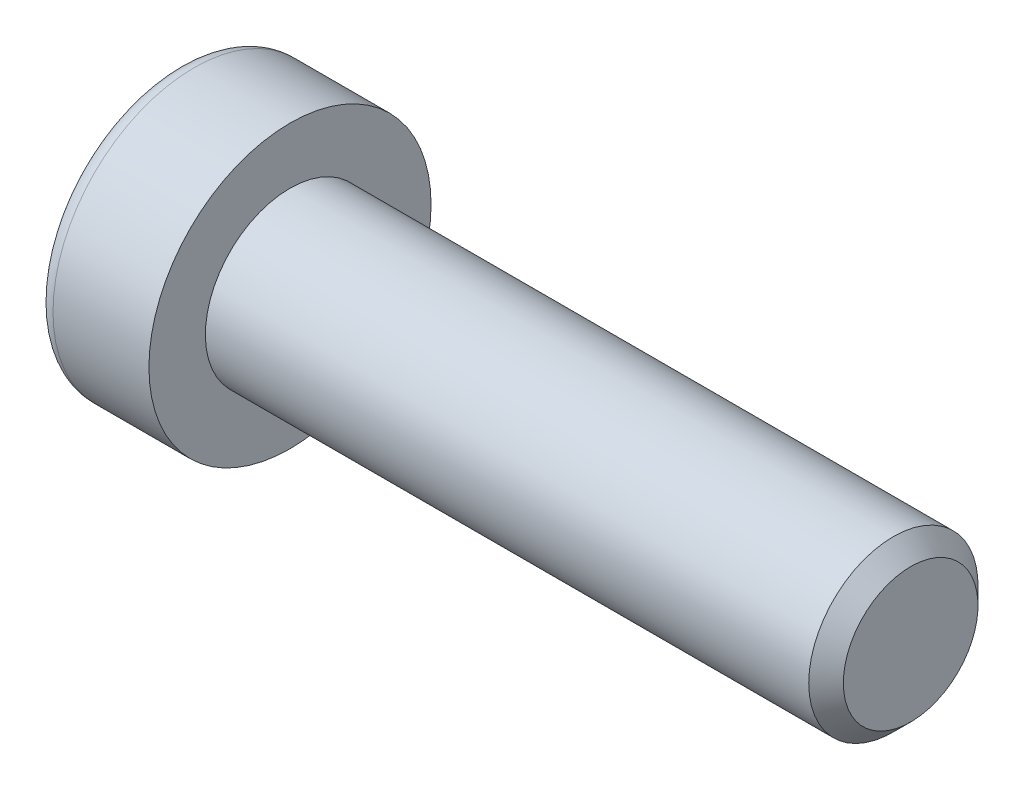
ISO-10303-21;
HEADER;
FILE_DESCRIPTION(('STEP AP214'),'2;1');
FILE_NAME('part.step','',(''),(''),'','','');
FILE_SCHEMA(('AUTOMOTIVE_DESIGN { 1 0 10303 214 1 1 1 1 }'));
ENDSEC;
DATA;
#1=APPLICATION_CONTEXT('core data for automotive mechanical design processes');
#2=APPLICATION_PROTOCOL_DEFINITION('international standard','automotive_design',2000,#1);
#3=PRODUCT_CONTEXT('',#1,'mechanical');
#4=PRODUCT('Part','Part','',(#3));
#5=PRODUCT_RELATED_PRODUCT_CATEGORY('part','',(#4));
#6=PRODUCT_DEFINITION_FORMATION('','',#4);
#7=PRODUCT_DEFINITION_CONTEXT('part definition',#1,'design');
#8=PRODUCT_DEFINITION('design','',#6,#7);
#9=PRODUCT_DEFINITION_SHAPE('','',#8);
#10=(LENGTH_UNIT() NAMED_UNIT(*) SI_UNIT(.MILLI.,.METRE.));
#11=(NAMED_UNIT(*) PLANE_ANGLE_UNIT() SI_UNIT($,.RADIAN.));
#12=(NAMED_UNIT(*) SI_UNIT($,.STERADIAN.) SOLID_ANGLE_UNIT());
#13=UNCERTAINTY_MEASURE_WITH_UNIT(LENGTH_MEASURE(1.E-05),#10,'distance_accuracy_value','');
#14=(GEOMETRIC_REPRESENTATION_CONTEXT(3) GLOBAL_UNCERTAINTY_ASSIGNED_CONTEXT((#13)) GLOBAL_UNIT_ASSIGNED_CONTEXT((#10,
#11,#12)) REPRESENTATION_CONTEXT('',''));
#15=CARTESIAN_POINT('',(0.,0.,0.));
#16=DIRECTION('',(0.,0.,1.));
#17=DIRECTION('',(1.,0.,0.));
#18=AXIS2_PLACEMENT_3D('',#15,#16,#17);
#19=CARTESIAN_POINT('',(-1.00800000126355,0.,0.));
#20=DIRECTION('',(-1.,0.,0.));
#21=DIRECTION('',(0.,0.,1.));
#22=AXIS2_PLACEMENT_3D('',#19,#20,#21);
#23=CONICAL_SURFACE('',#22,2.32325748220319,1.04719754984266);
#24=CARTESIAN_POINT('',(0.333333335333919,-2.27373675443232E-10,0.));
#25=VERTEX_POINT('',#24);
#26=VERTEX_LOOP('',#25);
#27=FACE_BOUND('',#26,.T.);
#28=CARTESIAN_POINT('',(-1.00000000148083,2.00000000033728,1.15470053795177));
#29=CARTESIAN_POINT('',(-0.970695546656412,2.00000000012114,1.05321634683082));
#30=CARTESIAN_POINT('',(-0.944044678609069,2.00000000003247,0.950856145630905));
#31=CARTESIAN_POINT('',(-0.897526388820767,1.99999999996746,0.744363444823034));
#32=CARTESIAN_POINT('',(-0.877675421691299,1.99999999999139,0.640227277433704));
#33=CARTESIAN_POINT('',(-0.84677596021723,2.0000000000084,0.433245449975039));
#34=CARTESIAN_POINT('',(-0.835521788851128,2.00000000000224,0.330431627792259));
#35=CARTESIAN_POINT('',(-0.822089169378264,1.99999999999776,0.124320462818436));
#36=CARTESIAN_POINT('',(-0.819899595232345,1.99999999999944,0.021023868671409));
#37=CARTESIAN_POINT('',(-0.824466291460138,2.00000000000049,-0.17197473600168));
#38=CARTESIAN_POINT('',(-0.830101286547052,2.00000000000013,-0.261705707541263));
#39=CARTESIAN_POINT('',(-0.847957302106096,1.99999999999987,-0.440583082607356));
#40=CARTESIAN_POINT('',(-0.86018441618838,1.99999999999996,-0.529728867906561));
#41=CARTESIAN_POINT('',(-0.890749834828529,2.00000000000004,-0.708974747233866));
#42=CARTESIAN_POINT('',(-0.909217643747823,2.00000000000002,-0.799052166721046));
#43=CARTESIAN_POINT('',(-0.95113176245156,1.99999999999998,-0.977863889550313));
#44=CARTESIAN_POINT('',(-0.974568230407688,1.99999999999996,-1.06660048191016));
#45=CARTESIAN_POINT('',(-1.00000000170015,2.,-1.15470053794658));
#46=B_SPLINE_CURVE_WITH_KNOTS('',3,(#28,#29,#30,#31,#32,#33,#34,#35,#36,#37,#38,#39,#40,#41,#42,
#43,#44,#45),.UNSPECIFIED.,.F.,.F.,(4,2,2,2,2,2,2,2,4),(0.,0.317016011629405,0.634793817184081,
0.944707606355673,1.25424088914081,1.52370778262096,1.79342419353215,2.06912162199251,
2.34427797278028),.UNSPECIFIED.);
#47=CARTESIAN_POINT('',(-1.00000000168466,1.99999999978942,1.15470053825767));
#48=VERTEX_POINT('',#47);
#49=CARTESIAN_POINT('',(-1.00000000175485,2.,-1.15470053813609));
#50=VERTEX_POINT('',#49);
#51=EDGE_CURVE('E20',#48,#50,#46,.T.);
#52=ORIENTED_EDGE('',*,*,#51,.T.);
#53=CARTESIAN_POINT('',(-1.00000000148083,1.99999999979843,-1.15470053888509));
#54=CARTESIAN_POINT('',(-0.970695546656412,1.91211211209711,-1.20544263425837));
#55=CARTESIAN_POINT('',(-0.944044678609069,1.82346557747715,-1.25662273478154));
#56=CARTESIAN_POINT('',(-0.897526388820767,1.64463765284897,-1.35986908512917));
#57=CARTESIAN_POINT('',(-0.877675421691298,1.55445308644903,-1.41193716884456));
#58=CARTESIAN_POINT('',(-0.846775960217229,1.37520156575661,-1.51542808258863));
#59=CARTESIAN_POINT('',(-0.835521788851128,1.28616218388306,-1.56683499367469));
#60=CARTESIAN_POINT('',(-0.822089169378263,1.10766467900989,-1.66989057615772));
#61=CARTESIAN_POINT('',(-0.819899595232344,1.01820720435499,-1.72153887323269));
#62=CARTESIAN_POINT('',(-0.824466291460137,0.851065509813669,-1.81803817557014));
#63=CARTESIAN_POINT('',(-0.830101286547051,0.773356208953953,-1.86290366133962));
#64=CARTESIAN_POINT('',(-0.847957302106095,0.618443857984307,-1.95234234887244));
#65=CARTESIAN_POINT('',(-0.860184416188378,0.541241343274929,-1.99691524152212));
#66=CARTESIAN_POINT('',(-0.890749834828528,0.38600985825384,-2.08653818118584));
#67=CARTESIAN_POINT('',(-0.909217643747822,0.308000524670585,-2.13157689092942));
#68=CARTESIAN_POINT('',(-0.951131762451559,0.153145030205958,-2.22098275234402));
#69=CARTESIAN_POINT('',(-0.974568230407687,0.0762968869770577,-2.26535104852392));
#70=CARTESIAN_POINT('',(-1.00000000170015,3.74707656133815E-10,-2.30940107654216));
#71=B_SPLINE_CURVE_WITH_KNOTS('',3,(#53,#54,#55,#56,#57,#58,#59,#60,#61,#62,#63,#64,#65,#66,#67,
#68,#69,#70),.UNSPECIFIED.,.F.,.F.,(4,2,2,2,2,2,2,2,4),(0.,0.317016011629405,0.63479381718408,
0.944707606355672,1.25424088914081,1.52370778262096,1.79342419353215,2.06912162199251,
2.34427797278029),.UNSPECIFIED.);
#72=CARTESIAN_POINT('',(-1.00000000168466,0.,-2.30940107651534));
#73=VERTEX_POINT('',#72);
#74=EDGE_CURVE('E80',#50,#73,#71,.T.);
#75=ORIENTED_EDGE('',*,*,#74,.T.);
#76=CARTESIAN_POINT('',(-1.00000000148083,-5.38851016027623E-10,-2.30940107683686));
#77=CARTESIAN_POINT('',(-0.970695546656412,-0.0878878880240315,-2.2586589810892));
#78=CARTESIAN_POINT('',(-0.944044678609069,-0.176534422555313,-2.20747888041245));
#79=CARTESIAN_POINT('',(-0.897526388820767,-0.355362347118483,-2.10423252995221));
#80=CARTESIAN_POINT('',(-0.877675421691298,-0.445546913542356,-2.05216444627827));
#81=CARTESIAN_POINT('',(-0.846775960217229,-0.624798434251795,-1.94867353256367));
#82=CARTESIAN_POINT('',(-0.835521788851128,-0.713837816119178,-1.89726662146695));
#83=CARTESIAN_POINT('',(-0.822089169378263,-0.892335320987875,-1.79421103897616));
#84=CARTESIAN_POINT('',(-0.819899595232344,-0.98179279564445,-1.7425627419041));
#85=CARTESIAN_POINT('',(-0.824466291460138,-1.14893449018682,-1.64606343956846));
#86=CARTESIAN_POINT('',(-0.830101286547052,-1.22664379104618,-1.60119795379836));
#87=CARTESIAN_POINT('',(-0.847957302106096,-1.38155614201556,-1.51175926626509));
#88=CARTESIAN_POINT('',(-0.860184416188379,-1.45875865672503,-1.46718637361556));
#89=CARTESIAN_POINT('',(-0.890749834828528,-1.6139901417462,-1.37756343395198));
#90=CARTESIAN_POINT('',(-0.909217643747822,-1.69199947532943,-1.33252472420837));
#91=CARTESIAN_POINT('',(-0.951131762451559,-1.84685496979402,-1.2431188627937));
#92=CARTESIAN_POINT('',(-0.974568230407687,-1.9237031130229,-1.19875056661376));
#93=CARTESIAN_POINT('',(-1.00000000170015,-1.99999999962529,-1.15470053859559));
#94=B_SPLINE_CURVE_WITH_KNOTS('',3,(#76,#77,#78,#79,#80,#81,#82,#83,#84,#85,#86,#87,#88,#89,#90,
#91,#92,#93),.UNSPECIFIED.,.F.,.F.,(4,2,2,2,2,2,2,2,4),(0.,0.317016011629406,0.634793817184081,
0.944707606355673,1.25424088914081,1.52370778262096,1.79342419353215,2.06912162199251,
2.34427797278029),.UNSPECIFIED.);
#95=CARTESIAN_POINT('',(-1.00000000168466,-1.99999999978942,-1.15470053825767));
#96=VERTEX_POINT('',#95);
#97=EDGE_CURVE('E105',#73,#96,#94,.T.);
#98=ORIENTED_EDGE('',*,*,#97,.T.);
#99=CARTESIAN_POINT('',(-1.00000000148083,-2.00000000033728,-1.15470053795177));
#100=CARTESIAN_POINT('',(-0.970695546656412,-2.00000000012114,-1.05321634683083));
#101=CARTESIAN_POINT('',(-0.944044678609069,-2.00000000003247,-0.950856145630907));
#102=CARTESIAN_POINT('',(-0.897526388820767,-1.99999999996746,-0.744363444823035));
#103=CARTESIAN_POINT('',(-0.877675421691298,-1.99999999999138,-0.640227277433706));
#104=CARTESIAN_POINT('',(-0.846775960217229,-2.0000000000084,-0.433245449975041));
#105=CARTESIAN_POINT('',(-0.835521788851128,-2.00000000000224,-0.330431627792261));
#106=CARTESIAN_POINT('',(-0.822089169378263,-1.99999999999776,-0.124320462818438));
#107=CARTESIAN_POINT('',(-0.819899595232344,-1.99999999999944,-0.0210238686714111));
#108=CARTESIAN_POINT('',(-0.824466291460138,-2.00000000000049,0.171974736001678));
#109=CARTESIAN_POINT('',(-0.830101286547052,-2.00000000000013,0.261705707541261));
#110=CARTESIAN_POINT('',(-0.847957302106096,-1.99999999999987,0.440583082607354));
#111=CARTESIAN_POINT('',(-0.860184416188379,-1.99999999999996,0.52972886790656));
#112=CARTESIAN_POINT('',(-0.890749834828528,-2.00000000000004,0.708974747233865));
#113=CARTESIAN_POINT('',(-0.909217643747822,-2.00000000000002,0.799052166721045));
#114=CARTESIAN_POINT('',(-0.951131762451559,-1.99999999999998,0.977863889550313));
#115=CARTESIAN_POINT('',(-0.974568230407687,-1.99999999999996,1.06660048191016));
#116=CARTESIAN_POINT('',(-1.00000000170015,-2.,1.15470053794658));
#117=B_SPLINE_CURVE_WITH_KNOTS('',3,(#99,#100,#101,#102,#103,#104,#105,#106,#107,#108,#109,#110,
#111,#112,#113,#114,#115,#116),.UNSPECIFIED.,.F.,.F.,(4,2,2,2,2,2,2,2,4),(0.,0.317016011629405,
0.63479381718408,0.944707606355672,1.25424088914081,1.52370778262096,1.79342419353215,
2.06912162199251,2.34427797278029),.UNSPECIFIED.);
#118=CARTESIAN_POINT('',(-1.00000000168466,-1.99999999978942,1.15470053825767));
#119=VERTEX_POINT('',#118);
#120=EDGE_CURVE('E129',#96,#119,#117,.T.);
#121=ORIENTED_EDGE('',*,*,#120,.T.);
#122=CARTESIAN_POINT('',(-1.00000000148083,-1.99999999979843,1.15470053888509));
#123=CARTESIAN_POINT('',(-0.970695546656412,-1.91211211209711,1.20544263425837));
#124=CARTESIAN_POINT('',(-0.944044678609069,-1.82346557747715,1.25662273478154));
#125=CARTESIAN_POINT('',(-0.897526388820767,-1.64463765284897,1.35986908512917));
#126=CARTESIAN_POINT('',(-0.877675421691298,-1.55445308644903,1.41193716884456));
#127=CARTESIAN_POINT('',(-0.846775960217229,-1.37520156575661,1.51542808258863));
#128=CARTESIAN_POINT('',(-0.835521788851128,-1.28616218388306,1.56683499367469));
#129=CARTESIAN_POINT('',(-0.822089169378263,-1.10766467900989,1.66989057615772));
#130=CARTESIAN_POINT('',(-0.819899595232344,-1.01820720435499,1.72153887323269));
#131=CARTESIAN_POINT('',(-0.824466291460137,-0.85106550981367,1.81803817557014));
#132=CARTESIAN_POINT('',(-0.830101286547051,-0.773356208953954,1.86290366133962));
#133=CARTESIAN_POINT('',(-0.847957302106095,-0.618443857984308,1.95234234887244));
#134=CARTESIAN_POINT('',(-0.860184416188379,-0.54124134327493,1.99691524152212));
#135=CARTESIAN_POINT('',(-0.890749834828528,-0.386009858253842,2.08653818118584));
#136=CARTESIAN_POINT('',(-0.909217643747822,-0.308000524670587,2.13157689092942));
#137=CARTESIAN_POINT('',(-0.951131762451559,-0.15314503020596,2.22098275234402));
#138=CARTESIAN_POINT('',(-0.974568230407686,-0.0762968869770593,2.26535104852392));
#139=CARTESIAN_POINT('',(-1.00000000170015,-3.74709270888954E-10,2.30940107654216));
#140=B_SPLINE_CURVE_WITH_KNOTS('',3,(#122,#123,#124,#125,#126,#127,#128,#129,#130,#131,#132,
#133,#134,#135,#136,#137,#138,#139),.UNSPECIFIED.,.F.,.F.,(4,2,2,2,2,2,2,2,4),(0.,
0.317016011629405,0.63479381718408,0.944707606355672,1.25424088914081,1.52370778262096,
1.79342419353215,2.06912162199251,2.34427797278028),.UNSPECIFIED.);
#141=CARTESIAN_POINT('',(-1.00000000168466,0.,2.30940107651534));
#142=VERTEX_POINT('',#141);
#143=EDGE_CURVE('E137',#119,#142,#140,.T.);
#144=ORIENTED_EDGE('',*,*,#143,.T.);
#145=CARTESIAN_POINT('',(-1.00000000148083,5.38850869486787E-10,2.30940107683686));
#146=CARTESIAN_POINT('',(-0.970695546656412,0.0878878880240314,2.2586589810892));
#147=CARTESIAN_POINT('',(-0.944044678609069,0.176534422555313,2.20747888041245));
#148=CARTESIAN_POINT('',(-0.897526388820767,0.355362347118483,2.10423252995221));
#149=CARTESIAN_POINT('',(-0.877675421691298,0.445546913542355,2.05216444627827));
#150=CARTESIAN_POINT('',(-0.846775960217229,0.624798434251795,1.94867353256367));
#151=CARTESIAN_POINT('',(-0.835521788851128,0.713837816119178,1.89726662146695));
#152=CARTESIAN_POINT('',(-0.822089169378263,0.892335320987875,1.79421103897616));
#153=CARTESIAN_POINT('',(-0.819899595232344,0.981792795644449,1.7425627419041));
#154=CARTESIAN_POINT('',(-0.824466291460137,1.14893449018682,1.64606343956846));
#155=CARTESIAN_POINT('',(-0.830101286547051,1.22664379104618,1.60119795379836));
#156=CARTESIAN_POINT('',(-0.847957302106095,1.38155614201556,1.51175926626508));
#157=CARTESIAN_POINT('',(-0.860184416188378,1.45875865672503,1.46718637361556));
#158=CARTESIAN_POINT('',(-0.890749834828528,1.6139901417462,1.37756343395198));
#159=CARTESIAN_POINT('',(-0.909217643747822,1.69199947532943,1.33252472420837));
#160=CARTESIAN_POINT('',(-0.951131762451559,1.84685496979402,1.2431188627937));
#161=CARTESIAN_POINT('',(-0.974568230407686,1.9237031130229,1.19875056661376));
#162=CARTESIAN_POINT('',(-1.00000000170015,1.99999999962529,1.15470053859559));
#163=B_SPLINE_CURVE_WITH_KNOTS('',3,(#145,#146,#147,#148,#149,#150,#151,#152,#153,#154,#155,
#156,#157,#158,#159,#160,#161,#162),.UNSPECIFIED.,.F.,.F.,(4,2,2,2,2,2,2,2,4),(0.,
0.317016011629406,0.63479381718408,0.944707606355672,1.25424088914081,1.52370778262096,
1.79342419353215,2.06912162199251,2.34427797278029),.UNSPECIFIED.);
#164=EDGE_CURVE('E82',#142,#48,#163,.T.);
#165=ORIENTED_EDGE('',*,*,#164,.T.);
#166=EDGE_LOOP('',(#52,#75,#98,#121,#144,#165));
#167=FACE_BOUND('',#166,.T.);
#168=ADVANCED_FACE('F16',(#27,#167),#23,.F.);
#169=CARTESIAN_POINT('',(-3.99999999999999,2.,1.15470053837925));
#170=DIRECTION('',(0.,1.,0.));
#171=DIRECTION('',(0.,0.,1.));
#172=AXIS2_PLACEMENT_3D('',#169,#170,#171);
#173=PLANE('',#172);
#174=DIRECTION('',(1.,0.,0.));
#175=VECTOR('',#174,1.);
#176=CARTESIAN_POINT('',(-3.99999999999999,2.,1.15470053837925));
#177=LINE('',#176,#175);
#178=CARTESIAN_POINT('',(-3.99999999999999,2.,1.15470053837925));
#179=VERTEX_POINT('',#178);
#180=EDGE_CURVE('E84',#48,#179,#177,.F.);
#181=ORIENTED_EDGE('',*,*,#180,.T.);
#182=DIRECTION('',(0.,0.,1.));
#183=VECTOR('',#182,1.);
#184=CARTESIAN_POINT('',(-3.99999999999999,2.,0.));
#185=LINE('',#184,#183);
#186=CARTESIAN_POINT('',(-3.99999999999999,2.,-1.15470053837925));
#187=VERTEX_POINT('',#186);
#188=EDGE_CURVE('E89',#187,#179,#185,.T.);
#189=ORIENTED_EDGE('',*,*,#188,.F.);
#190=DIRECTION('',(1.,0.,0.));
#191=VECTOR('',#190,1.);
#192=CARTESIAN_POINT('',(-3.99999999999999,2.,-1.15470053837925));
#193=LINE('',#192,#191);
#194=EDGE_CURVE('E87',#187,#50,#193,.T.);
#195=ORIENTED_EDGE('',*,*,#194,.T.);
#196=ORIENTED_EDGE('',*,*,#51,.F.);
#197=EDGE_LOOP('',(#181,#189,#195,#196));
#198=FACE_BOUND('',#197,.T.);
#199=ADVANCED_FACE('F76',(#198),#173,.F.);
#200=CARTESIAN_POINT('',(-3.99999999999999,0.,2.3094010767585));
#201=DIRECTION('',(0.,0.500000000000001,0.866025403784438));
#202=DIRECTION('',(0.,-0.866025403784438,0.500000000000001));
#203=AXIS2_PLACEMENT_3D('',#200,#201,#202);
#204=PLANE('',#203);
#205=DIRECTION('',(1.,0.,0.));
#206=VECTOR('',#205,1.);
#207=CARTESIAN_POINT('',(-3.99999999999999,0.,2.3094010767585));
#208=LINE('',#207,#206);
#209=CARTESIAN_POINT('',(-3.99999999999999,0.,2.3094010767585));
#210=VERTEX_POINT('',#209);
#211=EDGE_CURVE('E141',#142,#210,#208,.F.);
#212=ORIENTED_EDGE('',*,*,#211,.T.);
#213=DIRECTION('',(0.,-0.866025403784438,0.500000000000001));
#214=VECTOR('',#213,1.);
#215=CARTESIAN_POINT('',(-3.99999999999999,2.,1.15470053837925));
#216=LINE('',#215,#214);
#217=EDGE_CURVE('E95',#179,#210,#216,.T.);
#218=ORIENTED_EDGE('',*,*,#217,.F.);
#219=ORIENTED_EDGE('',*,*,#180,.F.);
#220=ORIENTED_EDGE('',*,*,#164,.F.);
#221=EDGE_LOOP('',(#212,#218,#219,#220));
#222=FACE_BOUND('',#221,.T.);
#223=ADVANCED_FACE('F145',(#222),#204,.F.);
#224=CARTESIAN_POINT('',(-3.99999999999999,-2.,1.15470053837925));
#225=DIRECTION('',(0.,-0.5,0.866025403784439));
#226=DIRECTION('',(0.,-0.866025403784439,-0.5));
#227=AXIS2_PLACEMENT_3D('',#224,#225,#226);
#228=PLANE('',#227);
#229=DIRECTION('',(1.,0.,0.));
#230=VECTOR('',#229,1.);
#231=CARTESIAN_POINT('',(-3.99999999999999,-2.,1.15470053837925));
#232=LINE('',#231,#230);
#233=CARTESIAN_POINT('',(-3.99999999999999,-2.,1.15470053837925));
#234=VERTEX_POINT('',#233);
#235=EDGE_CURVE('E136',#119,#234,#232,.F.);
#236=ORIENTED_EDGE('',*,*,#235,.T.);
#237=DIRECTION('',(0.,-0.866025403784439,-0.5));
#238=VECTOR('',#237,1.);
#239=CARTESIAN_POINT('',(-3.99999999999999,0.,2.3094010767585));
#240=LINE('',#239,#238);
#241=EDGE_CURVE('E224',#210,#234,#240,.T.);
#242=ORIENTED_EDGE('',*,*,#241,.F.);
#243=ORIENTED_EDGE('',*,*,#211,.F.);
#244=ORIENTED_EDGE('',*,*,#143,.F.);
#245=EDGE_LOOP('',(#236,#242,#243,#244));
#246=FACE_BOUND('',#245,.T.);
#247=ADVANCED_FACE('F125',(#246),#228,.F.);
#248=CARTESIAN_POINT('',(-3.99999999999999,-2.,-1.15470053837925));
#249=DIRECTION('',(0.,-1.,0.));
#250=DIRECTION('',(0.,0.,-1.));
#251=AXIS2_PLACEMENT_3D('',#248,#249,#250);
#252=PLANE('',#251);
#253=DIRECTION('',(1.,0.,0.));
#254=VECTOR('',#253,1.);
#255=CARTESIAN_POINT('',(-3.99999999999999,-2.,-1.15470053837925));
#256=LINE('',#255,#254);
#257=CARTESIAN_POINT('',(-3.99999999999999,-2.,-1.15470053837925));
#258=VERTEX_POINT('',#257);
#259=EDGE_CURVE('E135',#96,#258,#256,.F.);
#260=ORIENTED_EDGE('',*,*,#259,.T.);
#261=DIRECTION('',(0.,0.,1.));
#262=VECTOR('',#261,1.);
#263=CARTESIAN_POINT('',(-3.99999999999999,-2.,0.));
#264=LINE('',#263,#262);
#265=EDGE_CURVE('E221',#234,#258,#264,.F.);
#266=ORIENTED_EDGE('',*,*,#265,.F.);
#267=ORIENTED_EDGE('',*,*,#235,.F.);
#268=ORIENTED_EDGE('',*,*,#120,.F.);
#269=EDGE_LOOP('',(#260,#266,#267,#268));
#270=FACE_BOUND('',#269,.T.);
#271=ADVANCED_FACE('F121',(#270),#252,.F.);
#272=CARTESIAN_POINT('',(-3.99999999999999,0.,-2.3094010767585));
#273=DIRECTION('',(0.,-0.5,-0.866025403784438));
#274=DIRECTION('',(0.,0.866025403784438,-0.5));
#275=AXIS2_PLACEMENT_3D('',#272,#273,#274);
#276=PLANE('',#275);
#277=DIRECTION('',(1.,0.,0.));
#278=VECTOR('',#277,1.);
#279=CARTESIAN_POINT('',(-3.99999999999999,0.,-2.3094010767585));
#280=LINE('',#279,#278);
#281=CARTESIAN_POINT('',(-3.99999999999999,0.,-2.3094010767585));
#282=VERTEX_POINT('',#281);
#283=EDGE_CURVE('E38',#73,#282,#280,.F.);
#284=ORIENTED_EDGE('',*,*,#283,.T.);
#285=DIRECTION('',(0.,0.866025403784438,-0.5));
#286=VECTOR('',#285,1.);
#287=CARTESIAN_POINT('',(-3.99999999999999,-2.,-1.15470053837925));
#288=LINE('',#287,#286);
#289=EDGE_CURVE('E218',#258,#282,#288,.T.);
#290=ORIENTED_EDGE('',*,*,#289,.F.);
#291=ORIENTED_EDGE('',*,*,#259,.F.);
#292=ORIENTED_EDGE('',*,*,#97,.F.);
#293=EDGE_LOOP('',(#284,#290,#291,#292));
#294=FACE_BOUND('',#293,.T.);
#295=ADVANCED_FACE('F115',(#294),#276,.F.);
#296=CARTESIAN_POINT('',(-3.99999999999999,2.,-1.15470053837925));
#297=DIRECTION('',(0.,0.5,-0.866025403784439));
#298=DIRECTION('',(0.,0.866025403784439,0.5));
#299=AXIS2_PLACEMENT_3D('',#296,#297,#298);
#300=PLANE('',#299);
#301=ORIENTED_EDGE('',*,*,#194,.F.);
#302=DIRECTION('',(0.,0.866025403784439,0.5));
#303=VECTOR('',#302,1.);
#304=CARTESIAN_POINT('',(-3.99999999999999,0.,-2.3094010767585));
#305=LINE('',#304,#303);
#306=EDGE_CURVE('E216',#282,#187,#305,.T.);
#307=ORIENTED_EDGE('',*,*,#306,.F.);
#308=ORIENTED_EDGE('',*,*,#283,.F.);
#309=ORIENTED_EDGE('',*,*,#74,.F.);
#310=EDGE_LOOP('',(#301,#307,#308,#309));
#311=FACE_BOUND('',#310,.T.);
#312=ADVANCED_FACE('F93',(#311),#300,.F.);
#313=CARTESIAN_POINT('',(-3.99999999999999,3.65470053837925,0.));
#314=DIRECTION('',(-1.,0.,0.));
#315=DIRECTION('',(0.,0.,1.));
#316=AXIS2_PLACEMENT_3D('',#313,#314,#315);
#317=PLANE('',#316);
#318=ORIENTED_EDGE('',*,*,#289,.T.);
#319=ORIENTED_EDGE('',*,*,#306,.T.);
#320=ORIENTED_EDGE('',*,*,#188,.T.);
#321=ORIENTED_EDGE('',*,*,#217,.T.);
#322=ORIENTED_EDGE('',*,*,#241,.T.);
#323=ORIENTED_EDGE('',*,*,#265,.T.);
#324=EDGE_LOOP('',(#318,#319,#320,#321,#322,#323));
#325=FACE_BOUND('',#324,.T.);
#326=CARTESIAN_POINT('',(-3.99999999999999,0.,0.));
#327=DIRECTION('',(1.,0.,0.));
#328=DIRECTION('',(0.,1.,0.));
#329=AXIS2_PLACEMENT_3D('',#326,#327,#328);
#330=CIRCLE('',#329,4.4);
#331=CARTESIAN_POINT('',(-3.99999999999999,4.4,0.));
#332=VERTEX_POINT('',#331);
#333=EDGE_CURVE('E193',#332,#332,#330,.T.);
#334=ORIENTED_EDGE('',*,*,#333,.F.);
#335=EDGE_LOOP('',(#334));
#336=FACE_BOUND('',#335,.T.);
#337=ADVANCED_FACE('F114',(#325,#336),#317,.T.);
#338=CARTESIAN_POINT('',(-3.4,0.,0.));
#339=DIRECTION('',(1.,0.,0.));
#340=DIRECTION('',(0.,0.,-1.));
#341=AXIS2_PLACEMENT_3D('',#338,#339,#340);
#342=TOROIDAL_SURFACE('',#341,4.4,0.6);
#343=CARTESIAN_POINT('',(-3.4,0.,0.));
#344=DIRECTION('',(1.,0.,0.));
#345=DIRECTION('',(0.,1.,0.));
#346=AXIS2_PLACEMENT_3D('',#343,#344,#345);
#347=CIRCLE('',#346,5.);
#348=CARTESIAN_POINT('',(-3.4,5.,0.));
#349=VERTEX_POINT('',#348);
#350=EDGE_CURVE('E234',#349,#349,#347,.T.);
#351=ORIENTED_EDGE('',*,*,#350,.F.);
#352=EDGE_LOOP('',(#351));
#353=FACE_BOUND('',#352,.T.);
#354=ORIENTED_EDGE('',*,*,#333,.T.);
#355=EDGE_LOOP('',(#354));
#356=FACE_BOUND('',#355,.T.);
#357=ADVANCED_FACE('F177',(#353,#356),#342,.T.);
#358=CARTESIAN_POINT('',(-2.,0.,0.));
#359=DIRECTION('',(1.,0.,0.));
#360=DIRECTION('',(0.,1.,0.));
#361=AXIS2_PLACEMENT_3D('',#358,#359,#360);
#362=CYLINDRICAL_SURFACE('',#361,5.);
#363=ORIENTED_EDGE('',*,*,#350,.T.);
#364=EDGE_LOOP('',(#363));
#365=FACE_BOUND('',#364,.T.);
#366=CARTESIAN_POINT('',(0.,0.,0.));
#367=DIRECTION('',(1.,0.,0.));
#368=DIRECTION('',(0.,1.,0.));
#369=AXIS2_PLACEMENT_3D('',#366,#367,#368);
#370=CIRCLE('',#369,5.);
#371=CARTESIAN_POINT('',(0.,5.,0.));
#372=VERTEX_POINT('',#371);
#373=EDGE_CURVE('E103',#372,#372,#370,.T.);
#374=ORIENTED_EDGE('',*,*,#373,.F.);
#375=EDGE_LOOP('',(#374));
#376=FACE_BOUND('',#375,.T.);
#377=ADVANCED_FACE('F174',(#365,#376),#362,.T.);
#378=CARTESIAN_POINT('',(22.,1.5,0.));
#379=DIRECTION('',(1.,0.,0.));
#380=DIRECTION('',(0.,0.,-1.));
#381=AXIS2_PLACEMENT_3D('',#378,#379,#380);
#382=PLANE('',#381);
#383=CARTESIAN_POINT('',(22.0000000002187,0.,0.));
#384=DIRECTION('',(-1.,0.,0.));
#385=DIRECTION('',(0.,0.,1.));
#386=AXIS2_PLACEMENT_3D('',#383,#384,#385);
#387=CIRCLE('',#386,2.38655000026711);
#388=CARTESIAN_POINT('',(22.0000000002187,0.,2.38655000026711));
#389=VERTEX_POINT('',#388);
#390=EDGE_CURVE('E230',#389,#389,#387,.T.);
#391=ORIENTED_EDGE('',*,*,#390,.F.);
#392=EDGE_LOOP('',(#391));
#393=FACE_BOUND('',#392,.T.);
#394=ADVANCED_FACE('F170',(#393),#382,.T.);
#395=CARTESIAN_POINT('',(0.,4.,0.));
#396=DIRECTION('',(1.,0.,0.));
#397=DIRECTION('',(0.,0.,-1.));
#398=AXIS2_PLACEMENT_3D('',#395,#396,#397);
#399=PLANE('',#398);
#400=CARTESIAN_POINT('',(0.,0.,0.));
#401=DIRECTION('',(1.,0.,0.));
#402=DIRECTION('',(0.,1.,0.));
#403=AXIS2_PLACEMENT_3D('',#400,#401,#402);
#404=CIRCLE('',#403,3.);
#405=CARTESIAN_POINT('',(0.,3.,0.));
#406=VERTEX_POINT('',#405);
#407=EDGE_CURVE('E29',#406,#406,#404,.T.);
#408=ORIENTED_EDGE('',*,*,#407,.F.);
#409=EDGE_LOOP('',(#408));
#410=FACE_BOUND('',#409,.T.);
#411=ORIENTED_EDGE('',*,*,#373,.T.);
#412=EDGE_LOOP('',(#411));
#413=FACE_BOUND('',#412,.T.);
#414=ADVANCED_FACE('F163',(#410,#413),#399,.T.);
#415=CARTESIAN_POINT('',(21.3865499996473,0.,0.));
#416=DIRECTION('',(-1.,0.,0.));
#417=DIRECTION('',(0.,0.,1.));
#418=AXIS2_PLACEMENT_3D('',#415,#416,#417);
#419=CONICAL_SURFACE('',#418,2.99999999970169,0.78539816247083);
#420=ORIENTED_EDGE('',*,*,#390,.T.);
#421=EDGE_LOOP('',(#420));
#422=FACE_BOUND('',#421,.T.);
#423=CARTESIAN_POINT('',(21.38655,0.,0.));
#424=DIRECTION('',(1.,0.,0.));
#425=DIRECTION('',(0.,1.,0.));
#426=AXIS2_PLACEMENT_3D('',#423,#424,#425);
#427=CIRCLE('',#426,3.);
#428=CARTESIAN_POINT('',(21.38655,3.,0.));
#429=VERTEX_POINT('',#428);
#430=EDGE_CURVE('E11',#429,#429,#427,.F.);
#431=ORIENTED_EDGE('',*,*,#430,.F.);
#432=EDGE_LOOP('',(#431));
#433=FACE_BOUND('',#432,.T.);
#434=ADVANCED_FACE('F156',(#422,#433),#419,.T.);
#435=CARTESIAN_POINT('',(12.5,0.,0.));
#436=DIRECTION('',(1.,0.,0.));
#437=DIRECTION('',(0.,1.,0.));
#438=AXIS2_PLACEMENT_3D('',#435,#436,#437);
#439=CYLINDRICAL_SURFACE('',#438,3.);
#440=ORIENTED_EDGE('',*,*,#430,.T.);
#441=EDGE_LOOP('',(#440));
#442=FACE_BOUND('',#441,.T.);
#443=ORIENTED_EDGE('',*,*,#407,.T.);
#444=EDGE_LOOP('',(#443));
#445=FACE_BOUND('',#444,.T.);
#446=ADVANCED_FACE('F154',(#442,#445),#439,.T.);
#447=CLOSED_SHELL('',(#168,#199,#223,#247,#271,#295,#312,#337,#357,#377,#394,#414,#434,#446));
#448=MANIFOLD_SOLID_BREP('B1',#447);
#449=ADVANCED_BREP_SHAPE_REPRESENTATION('',(#18,#448),#14);
#450=SHAPE_DEFINITION_REPRESENTATION(#9,#449);
ENDSEC;
END-ISO-10303-21;
